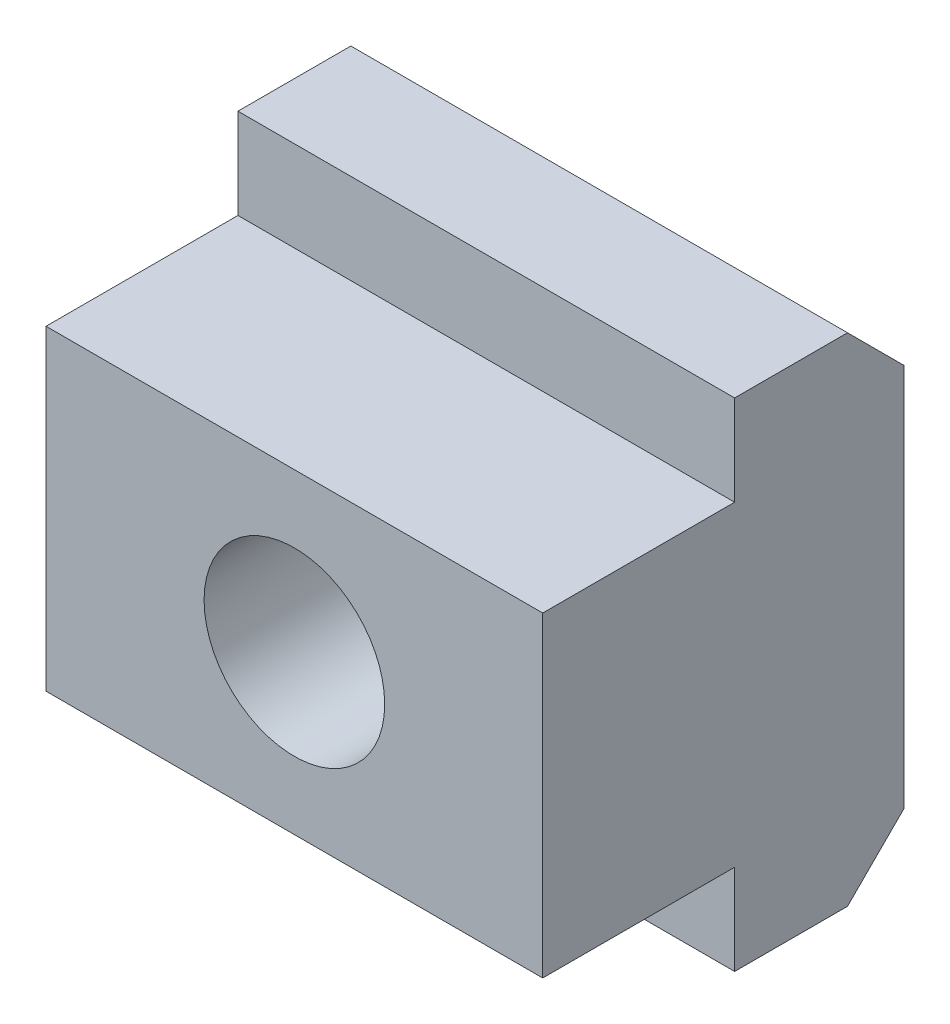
ISO-10303-21;
HEADER;
FILE_DESCRIPTION(('STEP AP214'),'2;1');
FILE_NAME('part.step','',(''),(''),'','','');
FILE_SCHEMA(('AUTOMOTIVE_DESIGN { 1 0 10303 214 1 1 1 1 }'));
ENDSEC;
DATA;
#1=APPLICATION_CONTEXT('core data for automotive mechanical design processes');
#2=APPLICATION_PROTOCOL_DEFINITION('international standard','automotive_design',2000,#1);
#3=PRODUCT_CONTEXT('',#1,'mechanical');
#4=PRODUCT('Part','Part','',(#3));
#5=PRODUCT_RELATED_PRODUCT_CATEGORY('part','',(#4));
#6=PRODUCT_DEFINITION_FORMATION('','',#4);
#7=PRODUCT_DEFINITION_CONTEXT('part definition',#1,'design');
#8=PRODUCT_DEFINITION('design','',#6,#7);
#9=PRODUCT_DEFINITION_SHAPE('','',#8);
#10=(LENGTH_UNIT() NAMED_UNIT(*) SI_UNIT(.MILLI.,.METRE.));
#11=(NAMED_UNIT(*) PLANE_ANGLE_UNIT() SI_UNIT($,.RADIAN.));
#12=(NAMED_UNIT(*) SI_UNIT($,.STERADIAN.) SOLID_ANGLE_UNIT());
#13=UNCERTAINTY_MEASURE_WITH_UNIT(LENGTH_MEASURE(1.E-05),#10,'distance_accuracy_value','');
#14=(GEOMETRIC_REPRESENTATION_CONTEXT(3) GLOBAL_UNCERTAINTY_ASSIGNED_CONTEXT((#13)) GLOBAL_UNIT_ASSIGNED_CONTEXT((#10,
#11,#12)) REPRESENTATION_CONTEXT('',''));
#15=CARTESIAN_POINT('',(0.,0.,0.));
#16=DIRECTION('',(0.,0.,1.));
#17=DIRECTION('',(1.,0.,0.));
#18=AXIS2_PLACEMENT_3D('',#15,#16,#17);
#19=CARTESIAN_POINT('',(11.,-6.99999999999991,1.3010426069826E-13));
#20=DIRECTION('',(0.,0.,-1.));
#21=DIRECTION('',(0.,1.,0.));
#22=AXIS2_PLACEMENT_3D('',#19,#20,#21);
#23=PLANE('',#22);
#24=DIRECTION('',(0.,-1.,0.));
#25=VECTOR('',#24,1.);
#26=CARTESIAN_POINT('',(-11.,-6.99999999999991,1.3010426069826E-13));
#27=LINE('',#26,#25);
#28=CARTESIAN_POINT('',(-11.,-6.99999999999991,1.3010426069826E-13));
#29=VERTEX_POINT('',#28);
#30=CARTESIAN_POINT('',(-11.,-10.9999999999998,1.10154940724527E-13));
#31=VERTEX_POINT('',#30);
#32=EDGE_CURVE('E97',#29,#31,#27,.T.);
#33=ORIENTED_EDGE('',*,*,#32,.T.);
#34=DIRECTION('',(-1.,0.,0.));
#35=VECTOR('',#34,1.);
#36=CARTESIAN_POINT('',(11.,-10.9999999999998,1.10154940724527E-13));
#37=LINE('',#36,#35);
#38=CARTESIAN_POINT('',(11.,-10.9999999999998,1.10154940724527E-13));
#39=VERTEX_POINT('',#38);
#40=EDGE_CURVE('E10',#39,#31,#37,.T.);
#41=ORIENTED_EDGE('',*,*,#40,.F.);
#42=DIRECTION('',(0.,-1.,0.));
#43=VECTOR('',#42,1.);
#44=CARTESIAN_POINT('',(11.,-6.99999999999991,1.3010426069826E-13));
#45=LINE('',#44,#43);
#46=CARTESIAN_POINT('',(11.,-6.99999999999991,1.3010426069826E-13));
#47=VERTEX_POINT('',#46);
#48=EDGE_CURVE('E133',#47,#39,#45,.T.);
#49=ORIENTED_EDGE('',*,*,#48,.F.);
#50=DIRECTION('',(-1.,0.,0.));
#51=VECTOR('',#50,1.);
#52=CARTESIAN_POINT('',(11.,-6.99999999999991,1.3010426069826E-13));
#53=LINE('',#52,#51);
#54=EDGE_CURVE('E110',#47,#29,#53,.T.);
#55=ORIENTED_EDGE('',*,*,#54,.T.);
#56=EDGE_LOOP('',(#33,#41,#49,#55));
#57=FACE_BOUND('',#56,.T.);
#58=ADVANCED_FACE('F17',(#57),#23,.F.);
#59=CARTESIAN_POINT('',(11.,-10.9999999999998,1.10154940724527E-13));
#60=DIRECTION('',(0.,1.,0.));
#61=DIRECTION('',(0.,0.,1.));
#62=AXIS2_PLACEMENT_3D('',#59,#60,#61);
#63=PLANE('',#62);
#64=DIRECTION('',(0.,0.,-1.));
#65=VECTOR('',#64,1.);
#66=CARTESIAN_POINT('',(-11.,-10.9999999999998,1.10154940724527E-13));
#67=LINE('',#66,#65);
#68=CARTESIAN_POINT('',(-11.,-10.9999999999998,-4.9999999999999));
#69=VERTEX_POINT('',#68);
#70=EDGE_CURVE('E93',#31,#69,#67,.T.);
#71=ORIENTED_EDGE('',*,*,#70,.T.);
#72=DIRECTION('',(-1.,0.,0.));
#73=VECTOR('',#72,1.);
#74=CARTESIAN_POINT('',(11.,-10.9999999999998,-4.9999999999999));
#75=LINE('',#74,#73);
#76=CARTESIAN_POINT('',(11.,-10.9999999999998,-4.9999999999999));
#77=VERTEX_POINT('',#76);
#78=EDGE_CURVE('E24',#77,#69,#75,.T.);
#79=ORIENTED_EDGE('',*,*,#78,.F.);
#80=DIRECTION('',(0.,0.,-1.));
#81=VECTOR('',#80,1.);
#82=CARTESIAN_POINT('',(11.,-10.9999999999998,1.10154940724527E-13));
#83=LINE('',#82,#81);
#84=EDGE_CURVE('E106',#39,#77,#83,.T.);
#85=ORIENTED_EDGE('',*,*,#84,.F.);
#86=ORIENTED_EDGE('',*,*,#40,.T.);
#87=EDGE_LOOP('',(#71,#79,#85,#86));
#88=FACE_BOUND('',#87,.T.);
#89=ADVANCED_FACE('F105',(#88),#63,.F.);
#90=CARTESIAN_POINT('',(11.,-10.9999999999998,-4.9999999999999));
#91=DIRECTION('',(0.,0.70710678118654,0.707106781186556));
#92=DIRECTION('',(0.,-0.707106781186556,0.70710678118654));
#93=AXIS2_PLACEMENT_3D('',#90,#91,#92);
#94=PLANE('',#93);
#95=DIRECTION('',(0.,0.707106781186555,-0.70710678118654));
#96=VECTOR('',#95,1.);
#97=CARTESIAN_POINT('',(-11.,-10.9999999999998,-4.9999999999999));
#98=LINE('',#97,#96);
#99=CARTESIAN_POINT('',(-11.,-8.49999999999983,-7.49999999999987));
#100=VERTEX_POINT('',#99);
#101=EDGE_CURVE('E99',#69,#100,#98,.T.);
#102=ORIENTED_EDGE('',*,*,#101,.T.);
#103=DIRECTION('',(-1.,0.,0.));
#104=VECTOR('',#103,1.);
#105=CARTESIAN_POINT('',(11.,-8.49999999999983,-7.49999999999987));
#106=LINE('',#105,#104);
#107=CARTESIAN_POINT('',(11.,-8.49999999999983,-7.49999999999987));
#108=VERTEX_POINT('',#107);
#109=EDGE_CURVE('E170',#108,#100,#106,.T.);
#110=ORIENTED_EDGE('',*,*,#109,.F.);
#111=DIRECTION('',(0.,0.707106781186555,-0.70710678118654));
#112=VECTOR('',#111,1.);
#113=CARTESIAN_POINT('',(11.,-10.9999999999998,-4.9999999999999));
#114=LINE('',#113,#112);
#115=EDGE_CURVE('E136',#77,#108,#114,.T.);
#116=ORIENTED_EDGE('',*,*,#115,.F.);
#117=ORIENTED_EDGE('',*,*,#78,.T.);
#118=EDGE_LOOP('',(#102,#110,#116,#117));
#119=FACE_BOUND('',#118,.T.);
#120=ADVANCED_FACE('F174',(#119),#94,.F.);
#121=CARTESIAN_POINT('',(11.,-8.49999999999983,-7.49999999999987));
#122=DIRECTION('',(0.,0.,1.));
#123=DIRECTION('',(0.,-1.,0.));
#124=AXIS2_PLACEMENT_3D('',#121,#122,#123);
#125=PLANE('',#124);
#126=CARTESIAN_POINT('',(0.,0.,-7.5));
#127=DIRECTION('',(0.,0.,1.));
#128=DIRECTION('',(1.,0.,0.));
#129=AXIS2_PLACEMENT_3D('',#126,#127,#128);
#130=CIRCLE('',#129,4.);
#131=CARTESIAN_POINT('',(4.,0.,-7.5));
#132=VERTEX_POINT('',#131);
#133=EDGE_CURVE('E114',#132,#132,#130,.T.);
#134=ORIENTED_EDGE('',*,*,#133,.T.);
#135=EDGE_LOOP('',(#134));
#136=FACE_BOUND('',#135,.T.);
#137=DIRECTION('',(0.,1.,0.));
#138=VECTOR('',#137,1.);
#139=CARTESIAN_POINT('',(-11.,-8.49999999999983,-7.49999999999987));
#140=LINE('',#139,#138);
#141=CARTESIAN_POINT('',(-11.,8.50000000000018,-7.49999999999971));
#142=VERTEX_POINT('',#141);
#143=EDGE_CURVE('E119',#100,#142,#140,.T.);
#144=ORIENTED_EDGE('',*,*,#143,.T.);
#145=DIRECTION('',(-1.,0.,0.));
#146=VECTOR('',#145,1.);
#147=CARTESIAN_POINT('',(11.,8.50000000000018,-7.49999999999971));
#148=LINE('',#147,#146);
#149=CARTESIAN_POINT('',(11.,8.50000000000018,-7.49999999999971));
#150=VERTEX_POINT('',#149);
#151=EDGE_CURVE('E167',#150,#142,#148,.T.);
#152=ORIENTED_EDGE('',*,*,#151,.F.);
#153=DIRECTION('',(0.,1.,0.));
#154=VECTOR('',#153,1.);
#155=CARTESIAN_POINT('',(11.,-8.49999999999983,-7.49999999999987));
#156=LINE('',#155,#154);
#157=EDGE_CURVE('E138',#108,#150,#156,.T.);
#158=ORIENTED_EDGE('',*,*,#157,.F.);
#159=ORIENTED_EDGE('',*,*,#109,.T.);
#160=EDGE_LOOP('',(#144,#152,#158,#159));
#161=FACE_BOUND('',#160,.T.);
#162=ADVANCED_FACE('F182',(#136,#161),#125,.F.);
#163=CARTESIAN_POINT('',(11.,8.50000000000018,-7.49999999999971));
#164=DIRECTION('',(0.,-0.70710678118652,0.707106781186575));
#165=DIRECTION('',(0.,-0.707106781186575,-0.70710678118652));
#166=AXIS2_PLACEMENT_3D('',#163,#164,#165);
#167=PLANE('',#166);
#168=DIRECTION('',(0.,0.707106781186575,0.70710678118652));
#169=VECTOR('',#168,1.);
#170=CARTESIAN_POINT('',(-11.,8.50000000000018,-7.49999999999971));
#171=LINE('',#170,#169);
#172=CARTESIAN_POINT('',(-11.,11.0000000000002,-5.));
#173=VERTEX_POINT('',#172);
#174=EDGE_CURVE('E121',#142,#173,#171,.T.);
#175=ORIENTED_EDGE('',*,*,#174,.T.);
#176=DIRECTION('',(-1.,0.,0.));
#177=VECTOR('',#176,1.);
#178=CARTESIAN_POINT('',(11.,11.0000000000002,-5.));
#179=LINE('',#178,#177);
#180=CARTESIAN_POINT('',(11.,11.0000000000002,-5.));
#181=VERTEX_POINT('',#180);
#182=EDGE_CURVE('E164',#181,#173,#179,.T.);
#183=ORIENTED_EDGE('',*,*,#182,.F.);
#184=DIRECTION('',(0.,0.707106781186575,0.70710678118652));
#185=VECTOR('',#184,1.);
#186=CARTESIAN_POINT('',(11.,8.50000000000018,-7.49999999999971));
#187=LINE('',#186,#185);
#188=EDGE_CURVE('E141',#150,#181,#187,.T.);
#189=ORIENTED_EDGE('',*,*,#188,.F.);
#190=ORIENTED_EDGE('',*,*,#151,.T.);
#191=EDGE_LOOP('',(#175,#183,#189,#190));
#192=FACE_BOUND('',#191,.T.);
#193=ADVANCED_FACE('F185',(#192),#167,.F.);
#194=CARTESIAN_POINT('',(11.,11.0000000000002,-5.));
#195=DIRECTION('',(0.,-1.,0.));
#196=DIRECTION('',(1.,0.,0.));
#197=AXIS2_PLACEMENT_3D('',#194,#195,#196);
#198=PLANE('',#197);
#199=DIRECTION('',(0.,0.,1.));
#200=VECTOR('',#199,1.);
#201=CARTESIAN_POINT('',(-11.,11.0000000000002,-5.));
#202=LINE('',#201,#200);
#203=CARTESIAN_POINT('',(-11.,11.0000000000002,0.));
#204=VERTEX_POINT('',#203);
#205=EDGE_CURVE('E123',#173,#204,#202,.T.);
#206=ORIENTED_EDGE('',*,*,#205,.T.);
#207=DIRECTION('',(-1.,0.,0.));
#208=VECTOR('',#207,1.);
#209=CARTESIAN_POINT('',(11.,11.0000000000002,0.));
#210=LINE('',#209,#208);
#211=CARTESIAN_POINT('',(11.,11.0000000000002,0.));
#212=VERTEX_POINT('',#211);
#213=EDGE_CURVE('E161',#212,#204,#210,.T.);
#214=ORIENTED_EDGE('',*,*,#213,.F.);
#215=DIRECTION('',(0.,0.,1.));
#216=VECTOR('',#215,1.);
#217=CARTESIAN_POINT('',(11.,11.0000000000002,-5.));
#218=LINE('',#217,#216);
#219=EDGE_CURVE('E143',#181,#212,#218,.T.);
#220=ORIENTED_EDGE('',*,*,#219,.F.);
#221=ORIENTED_EDGE('',*,*,#182,.T.);
#222=EDGE_LOOP('',(#206,#214,#220,#221));
#223=FACE_BOUND('',#222,.T.);
#224=ADVANCED_FACE('F190',(#223),#198,.F.);
#225=CARTESIAN_POINT('',(11.,11.0000000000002,0.));
#226=DIRECTION('',(0.,0.,-1.));
#227=DIRECTION('',(-1.,0.,0.));
#228=AXIS2_PLACEMENT_3D('',#225,#226,#227);
#229=PLANE('',#228);
#230=DIRECTION('',(0.,-1.,0.));
#231=VECTOR('',#230,1.);
#232=CARTESIAN_POINT('',(-11.,11.0000000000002,0.));
#233=LINE('',#232,#231);
#234=CARTESIAN_POINT('',(-11.,7.,0.));
#235=VERTEX_POINT('',#234);
#236=EDGE_CURVE('E125',#204,#235,#233,.T.);
#237=ORIENTED_EDGE('',*,*,#236,.T.);
#238=DIRECTION('',(-1.,0.,0.));
#239=VECTOR('',#238,1.);
#240=CARTESIAN_POINT('',(11.,7.,0.));
#241=LINE('',#240,#239);
#242=CARTESIAN_POINT('',(11.,7.,0.));
#243=VERTEX_POINT('',#242);
#244=EDGE_CURVE('E158',#243,#235,#241,.T.);
#245=ORIENTED_EDGE('',*,*,#244,.F.);
#246=DIRECTION('',(0.,-1.,0.));
#247=VECTOR('',#246,1.);
#248=CARTESIAN_POINT('',(11.,11.0000000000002,0.));
#249=LINE('',#248,#247);
#250=EDGE_CURVE('E145',#212,#243,#249,.T.);
#251=ORIENTED_EDGE('',*,*,#250,.F.);
#252=ORIENTED_EDGE('',*,*,#213,.T.);
#253=EDGE_LOOP('',(#237,#245,#251,#252));
#254=FACE_BOUND('',#253,.T.);
#255=ADVANCED_FACE('F196',(#254),#229,.F.);
#256=CARTESIAN_POINT('',(11.,7.,0.));
#257=DIRECTION('',(0.,-1.,0.));
#258=DIRECTION('',(1.,0.,0.));
#259=AXIS2_PLACEMENT_3D('',#256,#257,#258);
#260=PLANE('',#259);
#261=DIRECTION('',(0.,0.,1.));
#262=VECTOR('',#261,1.);
#263=CARTESIAN_POINT('',(-11.,7.,0.));
#264=LINE('',#263,#262);
#265=CARTESIAN_POINT('',(-11.,7.,8.50000000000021));
#266=VERTEX_POINT('',#265);
#267=EDGE_CURVE('E127',#235,#266,#264,.T.);
#268=ORIENTED_EDGE('',*,*,#267,.T.);
#269=DIRECTION('',(-1.,0.,0.));
#270=VECTOR('',#269,1.);
#271=CARTESIAN_POINT('',(11.,7.,8.50000000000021));
#272=LINE('',#271,#270);
#273=CARTESIAN_POINT('',(11.,7.,8.50000000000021));
#274=VERTEX_POINT('',#273);
#275=EDGE_CURVE('E155',#274,#266,#272,.T.);
#276=ORIENTED_EDGE('',*,*,#275,.F.);
#277=DIRECTION('',(0.,0.,1.));
#278=VECTOR('',#277,1.);
#279=CARTESIAN_POINT('',(11.,7.,0.));
#280=LINE('',#279,#278);
#281=EDGE_CURVE('E146',#243,#274,#280,.T.);
#282=ORIENTED_EDGE('',*,*,#281,.F.);
#283=ORIENTED_EDGE('',*,*,#244,.T.);
#284=EDGE_LOOP('',(#268,#276,#282,#283));
#285=FACE_BOUND('',#284,.T.);
#286=ADVANCED_FACE('F200',(#285),#260,.F.);
#287=CARTESIAN_POINT('',(11.,7.,8.50000000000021));
#288=DIRECTION('',(0.,0.,-1.));
#289=DIRECTION('',(0.,1.,0.));
#290=AXIS2_PLACEMENT_3D('',#287,#288,#289);
#291=PLANE('',#290);
#292=CARTESIAN_POINT('',(0.,0.,8.50000000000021));
#293=DIRECTION('',(0.,0.,1.));
#294=DIRECTION('',(1.,0.,0.));
#295=AXIS2_PLACEMENT_3D('',#292,#293,#294);
#296=CIRCLE('',#295,4.);
#297=CARTESIAN_POINT('',(4.,0.,8.50000000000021));
#298=VERTEX_POINT('',#297);
#299=EDGE_CURVE('E111',#298,#298,#296,.T.);
#300=ORIENTED_EDGE('',*,*,#299,.F.);
#301=EDGE_LOOP('',(#300));
#302=FACE_BOUND('',#301,.T.);
#303=DIRECTION('',(0.,-1.,0.));
#304=VECTOR('',#303,1.);
#305=CARTESIAN_POINT('',(-11.,7.,8.50000000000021));
#306=LINE('',#305,#304);
#307=CARTESIAN_POINT('',(-11.,-7.,8.50000000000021));
#308=VERTEX_POINT('',#307);
#309=EDGE_CURVE('E129',#266,#308,#306,.T.);
#310=ORIENTED_EDGE('',*,*,#309,.T.);
#311=DIRECTION('',(-1.,0.,0.));
#312=VECTOR('',#311,1.);
#313=CARTESIAN_POINT('',(11.,-7.,8.50000000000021));
#314=LINE('',#313,#312);
#315=CARTESIAN_POINT('',(11.,-7.,8.50000000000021));
#316=VERTEX_POINT('',#315);
#317=EDGE_CURVE('E152',#316,#308,#314,.T.);
#318=ORIENTED_EDGE('',*,*,#317,.F.);
#319=DIRECTION('',(0.,-1.,0.));
#320=VECTOR('',#319,1.);
#321=CARTESIAN_POINT('',(11.,7.,8.50000000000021));
#322=LINE('',#321,#320);
#323=EDGE_CURVE('E36',#274,#316,#322,.T.);
#324=ORIENTED_EDGE('',*,*,#323,.F.);
#325=ORIENTED_EDGE('',*,*,#275,.T.);
#326=EDGE_LOOP('',(#310,#318,#324,#325));
#327=FACE_BOUND('',#326,.T.);
#328=ADVANCED_FACE('F203',(#302,#327),#291,.F.);
#329=CARTESIAN_POINT('',(11.,-7.,8.50000000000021));
#330=DIRECTION('',(0.,1.,0.));
#331=DIRECTION('',(0.,0.,1.));
#332=AXIS2_PLACEMENT_3D('',#329,#330,#331);
#333=PLANE('',#332);
#334=DIRECTION('',(0.,0.,-1.));
#335=VECTOR('',#334,1.);
#336=CARTESIAN_POINT('',(-11.,-7.,8.50000000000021));
#337=LINE('',#336,#335);
#338=EDGE_CURVE('E131',#308,#29,#337,.T.);
#339=ORIENTED_EDGE('',*,*,#338,.T.);
#340=ORIENTED_EDGE('',*,*,#54,.F.);
#341=DIRECTION('',(0.,0.,-1.));
#342=VECTOR('',#341,1.);
#343=CARTESIAN_POINT('',(11.,-7.,8.50000000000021));
#344=LINE('',#343,#342);
#345=EDGE_CURVE('E31',#316,#47,#344,.T.);
#346=ORIENTED_EDGE('',*,*,#345,.F.);
#347=ORIENTED_EDGE('',*,*,#317,.T.);
#348=EDGE_LOOP('',(#339,#340,#346,#347));
#349=FACE_BOUND('',#348,.T.);
#350=ADVANCED_FACE('F205',(#349),#333,.F.);
#351=CARTESIAN_POINT('',(11.,-6.99999999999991,1.3010426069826E-13));
#352=DIRECTION('',(1.,0.,0.));
#353=DIRECTION('',(0.,1.,0.));
#354=AXIS2_PLACEMENT_3D('',#351,#352,#353);
#355=PLANE('',#354);
#356=ORIENTED_EDGE('',*,*,#48,.T.);
#357=ORIENTED_EDGE('',*,*,#84,.T.);
#358=ORIENTED_EDGE('',*,*,#115,.T.);
#359=ORIENTED_EDGE('',*,*,#157,.T.);
#360=ORIENTED_EDGE('',*,*,#188,.T.);
#361=ORIENTED_EDGE('',*,*,#219,.T.);
#362=ORIENTED_EDGE('',*,*,#250,.T.);
#363=ORIENTED_EDGE('',*,*,#281,.T.);
#364=ORIENTED_EDGE('',*,*,#323,.T.);
#365=ORIENTED_EDGE('',*,*,#345,.T.);
#366=EDGE_LOOP('',(#356,#357,#358,#359,#360,#361,#362,#363,#364,#365));
#367=FACE_BOUND('',#366,.T.);
#368=ADVANCED_FACE('F177',(#367),#355,.T.);
#369=CARTESIAN_POINT('',(-11.,-6.99999999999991,1.3010426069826E-13));
#370=DIRECTION('',(1.,0.,0.));
#371=DIRECTION('',(0.,1.,0.));
#372=AXIS2_PLACEMENT_3D('',#369,#370,#371);
#373=PLANE('',#372);
#374=ORIENTED_EDGE('',*,*,#32,.F.);
#375=ORIENTED_EDGE('',*,*,#338,.F.);
#376=ORIENTED_EDGE('',*,*,#309,.F.);
#377=ORIENTED_EDGE('',*,*,#267,.F.);
#378=ORIENTED_EDGE('',*,*,#236,.F.);
#379=ORIENTED_EDGE('',*,*,#205,.F.);
#380=ORIENTED_EDGE('',*,*,#174,.F.);
#381=ORIENTED_EDGE('',*,*,#143,.F.);
#382=ORIENTED_EDGE('',*,*,#101,.F.);
#383=ORIENTED_EDGE('',*,*,#70,.F.);
#384=EDGE_LOOP('',(#374,#375,#376,#377,#378,#379,#380,#381,#382,#383));
#385=FACE_BOUND('',#384,.T.);
#386=ADVANCED_FACE('F94',(#385),#373,.F.);
#387=CARTESIAN_POINT('',(0.,0.,8.50000000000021));
#388=DIRECTION('',(0.,0.,1.));
#389=DIRECTION('',(1.,0.,0.));
#390=AXIS2_PLACEMENT_3D('',#387,#388,#389);
#391=CYLINDRICAL_SURFACE('',#390,4.);
#392=ORIENTED_EDGE('',*,*,#133,.F.);
#393=EDGE_LOOP('',(#392));
#394=FACE_BOUND('',#393,.T.);
#395=ORIENTED_EDGE('',*,*,#299,.T.);
#396=EDGE_LOOP('',(#395));
#397=FACE_BOUND('',#396,.T.);
#398=ADVANCED_FACE('F308',(#394,#397),#391,.F.);
#399=CLOSED_SHELL('',(#58,#89,#120,#162,#193,#224,#255,#286,#328,#350,#368,#386,#398));
#400=MANIFOLD_SOLID_BREP('B1',#399);
#401=ADVANCED_BREP_SHAPE_REPRESENTATION('',(#18,#400),#14);
#402=SHAPE_DEFINITION_REPRESENTATION(#9,#401);
ENDSEC;
END-ISO-10303-21;
